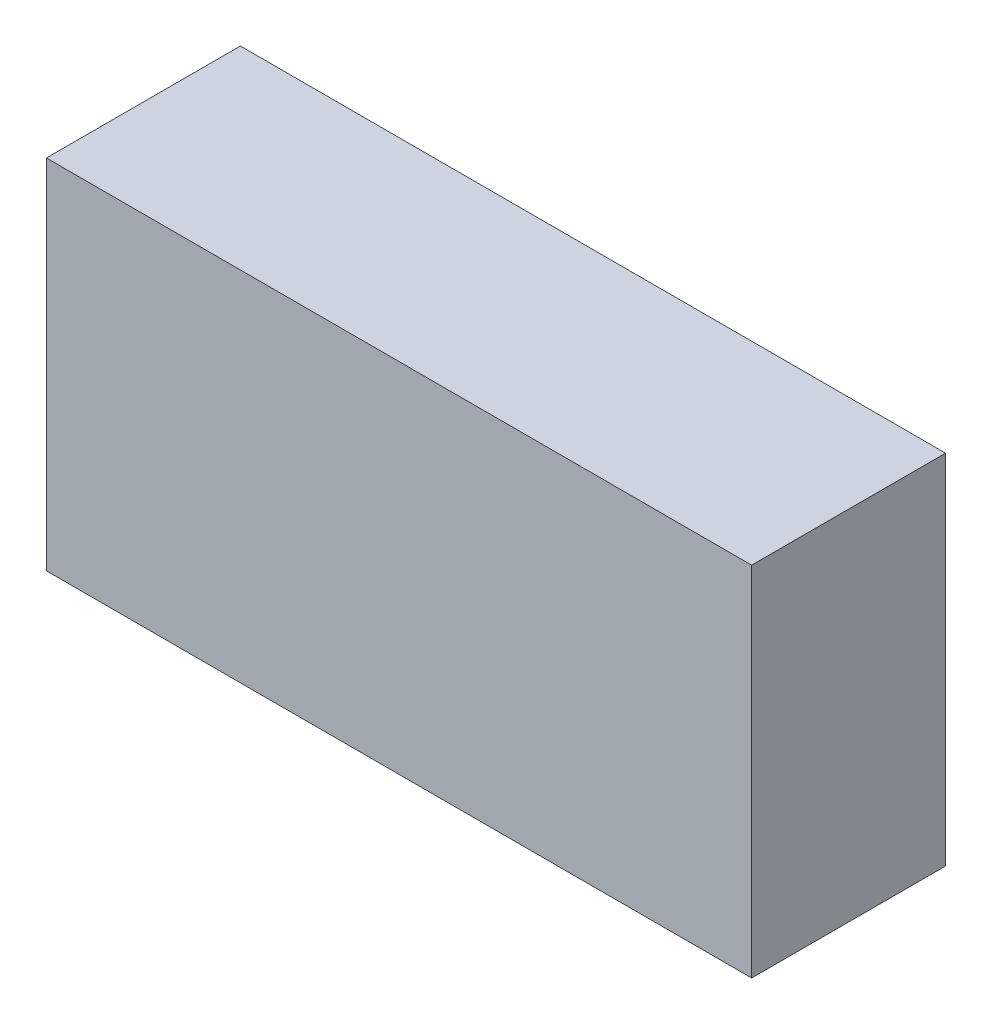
ISO-10303-21;
HEADER;
FILE_DESCRIPTION(('STEP AP214'),'2;1');
FILE_NAME('part.step','',(''),(''),'','','');
FILE_SCHEMA(('AUTOMOTIVE_DESIGN { 1 0 10303 214 1 1 1 1 }'));
ENDSEC;
DATA;
#1=APPLICATION_CONTEXT('core data for automotive mechanical design processes');
#2=APPLICATION_PROTOCOL_DEFINITION('international standard','automotive_design',2000,#1);
#3=PRODUCT_CONTEXT('',#1,'mechanical');
#4=PRODUCT('Part','Part','',(#3));
#5=PRODUCT_RELATED_PRODUCT_CATEGORY('part','',(#4));
#6=PRODUCT_DEFINITION_FORMATION('','',#4);
#7=PRODUCT_DEFINITION_CONTEXT('part definition',#1,'design');
#8=PRODUCT_DEFINITION('design','',#6,#7);
#9=PRODUCT_DEFINITION_SHAPE('','',#8);
#10=(LENGTH_UNIT() NAMED_UNIT(*) SI_UNIT(.MILLI.,.METRE.));
#11=(NAMED_UNIT(*) PLANE_ANGLE_UNIT() SI_UNIT($,.RADIAN.));
#12=(NAMED_UNIT(*) SI_UNIT($,.STERADIAN.) SOLID_ANGLE_UNIT());
#13=UNCERTAINTY_MEASURE_WITH_UNIT(LENGTH_MEASURE(1.E-05),#10,'distance_accuracy_value','');
#14=(GEOMETRIC_REPRESENTATION_CONTEXT(3) GLOBAL_UNCERTAINTY_ASSIGNED_CONTEXT((#13)) GLOBAL_UNIT_ASSIGNED_CONTEXT((#10,
#11,#12)) REPRESENTATION_CONTEXT('',''));
#15=CARTESIAN_POINT('',(0.,0.,0.));
#16=DIRECTION('',(0.,0.,1.));
#17=DIRECTION('',(1.,0.,0.));
#18=AXIS2_PLACEMENT_3D('',#15,#16,#17);
#19=CARTESIAN_POINT('',(0.,0.,0.55));
#20=DIRECTION('',(0.,0.,1.));
#21=DIRECTION('',(1.,0.,0.));
#22=AXIS2_PLACEMENT_3D('',#19,#20,#21);
#23=PLANE('',#22);
#24=DIRECTION('',(0.,1.,0.));
#25=VECTOR('',#24,1.);
#26=CARTESIAN_POINT('',(-1.,0.,0.55));
#27=LINE('',#26,#25);
#28=CARTESIAN_POINT('',(-1.,0.507,0.55));
#29=VERTEX_POINT('',#28);
#30=CARTESIAN_POINT('',(-1.,-0.507,0.55));
#31=VERTEX_POINT('',#30);
#32=EDGE_CURVE('E20',#29,#31,#27,.F.);
#33=ORIENTED_EDGE('',*,*,#32,.T.);
#34=DIRECTION('',(1.,0.,0.));
#35=VECTOR('',#34,1.);
#36=CARTESIAN_POINT('',(-1.,-0.507,0.55));
#37=LINE('',#36,#35);
#38=CARTESIAN_POINT('',(1.,-0.507,0.55));
#39=VERTEX_POINT('',#38);
#40=EDGE_CURVE('E68',#39,#31,#37,.F.);
#41=ORIENTED_EDGE('',*,*,#40,.F.);
#42=DIRECTION('',(0.,1.,0.));
#43=VECTOR('',#42,1.);
#44=CARTESIAN_POINT('',(1.,0.075,0.55));
#45=LINE('',#44,#43);
#46=CARTESIAN_POINT('',(1.,0.507,0.55));
#47=VERTEX_POINT('',#46);
#48=EDGE_CURVE('E58',#47,#39,#45,.F.);
#49=ORIENTED_EDGE('',*,*,#48,.F.);
#50=DIRECTION('',(1.,0.,0.));
#51=VECTOR('',#50,1.);
#52=CARTESIAN_POINT('',(1.,0.507,0.55));
#53=LINE('',#52,#51);
#54=EDGE_CURVE('E53',#29,#47,#53,.T.);
#55=ORIENTED_EDGE('',*,*,#54,.F.);
#56=EDGE_LOOP('',(#33,#41,#49,#55));
#57=FACE_BOUND('',#56,.T.);
#58=ADVANCED_FACE('F17',(#57),#23,.T.);
#59=CARTESIAN_POINT('',(-1.,-0.507,0.));
#60=DIRECTION('',(0.,-1.,0.));
#61=DIRECTION('',(0.,0.,-1.));
#62=AXIS2_PLACEMENT_3D('',#59,#60,#61);
#63=PLANE('',#62);
#64=DIRECTION('',(0.,0.,1.));
#65=VECTOR('',#64,1.);
#66=CARTESIAN_POINT('',(-1.,-0.507,0.));
#67=LINE('',#66,#65);
#68=CARTESIAN_POINT('',(-1.,-0.507,0.));
#69=VERTEX_POINT('',#68);
#70=EDGE_CURVE('E81',#69,#31,#67,.T.);
#71=ORIENTED_EDGE('',*,*,#70,.F.);
#72=DIRECTION('',(1.,0.,0.));
#73=VECTOR('',#72,1.);
#74=CARTESIAN_POINT('',(0.,-0.507,0.));
#75=LINE('',#74,#73);
#76=CARTESIAN_POINT('',(1.,-0.507,0.));
#77=VERTEX_POINT('',#76);
#78=EDGE_CURVE('E75',#69,#77,#75,.T.);
#79=ORIENTED_EDGE('',*,*,#78,.T.);
#80=DIRECTION('',(0.,0.,-1.));
#81=VECTOR('',#80,1.);
#82=CARTESIAN_POINT('',(1.,-0.507,0.));
#83=LINE('',#82,#81);
#84=EDGE_CURVE('E62',#39,#77,#83,.T.);
#85=ORIENTED_EDGE('',*,*,#84,.F.);
#86=ORIENTED_EDGE('',*,*,#40,.T.);
#87=EDGE_LOOP('',(#71,#79,#85,#86));
#88=FACE_BOUND('',#87,.T.);
#89=ADVANCED_FACE('F73',(#88),#63,.T.);
#90=CARTESIAN_POINT('',(1.,0.075,0.));
#91=DIRECTION('',(1.,0.,0.));
#92=DIRECTION('',(0.,0.,-1.));
#93=AXIS2_PLACEMENT_3D('',#90,#91,#92);
#94=PLANE('',#93);
#95=ORIENTED_EDGE('',*,*,#48,.T.);
#96=ORIENTED_EDGE('',*,*,#84,.T.);
#97=DIRECTION('',(0.,1.,0.));
#98=VECTOR('',#97,1.);
#99=CARTESIAN_POINT('',(1.,0.,0.));
#100=LINE('',#99,#98);
#101=CARTESIAN_POINT('',(1.,0.507,0.));
#102=VERTEX_POINT('',#101);
#103=EDGE_CURVE('E84',#77,#102,#100,.T.);
#104=ORIENTED_EDGE('',*,*,#103,.T.);
#105=DIRECTION('',(0.,0.,1.));
#106=VECTOR('',#105,1.);
#107=CARTESIAN_POINT('',(1.,0.507,0.));
#108=LINE('',#107,#106);
#109=EDGE_CURVE('E64',#47,#102,#108,.F.);
#110=ORIENTED_EDGE('',*,*,#109,.F.);
#111=EDGE_LOOP('',(#95,#96,#104,#110));
#112=FACE_BOUND('',#111,.T.);
#113=ADVANCED_FACE('F60',(#112),#94,.T.);
#114=CARTESIAN_POINT('',(1.,0.507,0.));
#115=DIRECTION('',(0.,1.,0.));
#116=DIRECTION('',(0.,0.,1.));
#117=AXIS2_PLACEMENT_3D('',#114,#115,#116);
#118=PLANE('',#117);
#119=ORIENTED_EDGE('',*,*,#109,.T.);
#120=DIRECTION('',(1.,0.,0.));
#121=VECTOR('',#120,1.);
#122=CARTESIAN_POINT('',(0.,0.507,0.));
#123=LINE('',#122,#121);
#124=CARTESIAN_POINT('',(-1.,0.507,0.));
#125=VERTEX_POINT('',#124);
#126=EDGE_CURVE('E26',#102,#125,#123,.F.);
#127=ORIENTED_EDGE('',*,*,#126,.T.);
#128=DIRECTION('',(0.,0.,1.));
#129=VECTOR('',#128,1.);
#130=CARTESIAN_POINT('',(-1.,0.507,0.));
#131=LINE('',#130,#129);
#132=EDGE_CURVE('E34',#29,#125,#131,.F.);
#133=ORIENTED_EDGE('',*,*,#132,.F.);
#134=ORIENTED_EDGE('',*,*,#54,.T.);
#135=EDGE_LOOP('',(#119,#127,#133,#134));
#136=FACE_BOUND('',#135,.T.);
#137=ADVANCED_FACE('F88',(#136),#118,.T.);
#138=CARTESIAN_POINT('',(-1.,-0.075,0.));
#139=DIRECTION('',(-1.,0.,0.));
#140=DIRECTION('',(0.,0.,1.));
#141=AXIS2_PLACEMENT_3D('',#138,#139,#140);
#142=PLANE('',#141);
#143=ORIENTED_EDGE('',*,*,#32,.F.);
#144=ORIENTED_EDGE('',*,*,#132,.T.);
#145=DIRECTION('',(0.,1.,0.));
#146=VECTOR('',#145,1.);
#147=CARTESIAN_POINT('',(-1.,0.,0.));
#148=LINE('',#147,#146);
#149=EDGE_CURVE('E11',#125,#69,#148,.F.);
#150=ORIENTED_EDGE('',*,*,#149,.T.);
#151=ORIENTED_EDGE('',*,*,#70,.T.);
#152=EDGE_LOOP('',(#143,#144,#150,#151));
#153=FACE_BOUND('',#152,.T.);
#154=ADVANCED_FACE('F91',(#153),#142,.T.);
#155=CARTESIAN_POINT('',(0.,0.,0.));
#156=DIRECTION('',(0.,0.,1.));
#157=DIRECTION('',(1.,0.,0.));
#158=AXIS2_PLACEMENT_3D('',#155,#156,#157);
#159=PLANE('',#158);
#160=ORIENTED_EDGE('',*,*,#78,.F.);
#161=ORIENTED_EDGE('',*,*,#149,.F.);
#162=ORIENTED_EDGE('',*,*,#126,.F.);
#163=ORIENTED_EDGE('',*,*,#103,.F.);
#164=EDGE_LOOP('',(#160,#161,#162,#163));
#165=FACE_BOUND('',#164,.T.);
#166=ADVANCED_FACE('F90',(#165),#159,.F.);
#167=CLOSED_SHELL('',(#58,#89,#113,#137,#154,#166));
#168=MANIFOLD_SOLID_BREP('B1',#167);
#169=ADVANCED_BREP_SHAPE_REPRESENTATION('',(#18,#168),#14);
#170=SHAPE_DEFINITION_REPRESENTATION(#9,#169);
ENDSEC;
END-ISO-10303-21;
